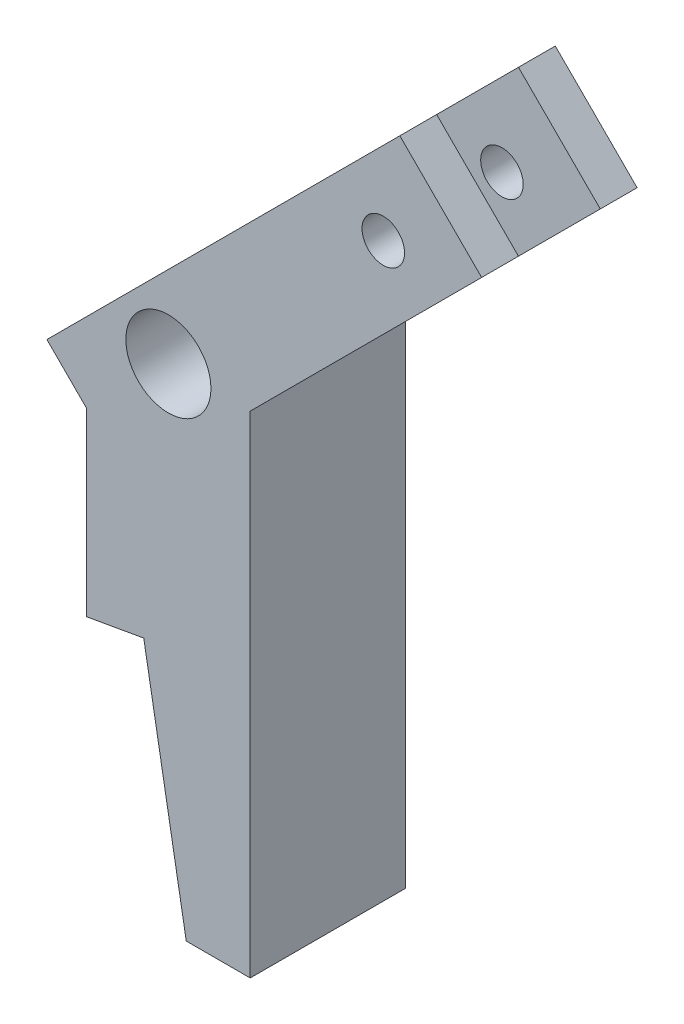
from build123d import *

# Parameters (mm, degrees)
SKIZZE1_W                            = 10
SKIZZE1_H                            = 30
AUFSATZ_LINEAR_AUSTRAGEN1_DEPTH      = 9.5
AUFSATZ_LINEAR_AUSTRAGEN2_DEPTH      = 20
AUFSATZ_LINEAR_AUSTRAGEN2_DEPTH_BACK = 10.5
SKIZZE2_W                            = 9.5
SKIZZE2_H                            = 7.071067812
SKIZZE3_R                            = 2.6
SCHNITT_LINEAR_AUSTRAGEN1_DEPTH      = 10
SKIZZE4_W                            = 5
SKIZZE4_H                            = 15.227770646
SCHNITT_LINEAR_AUSTRAGEN2_DEPTH      = 10
SKIZZE5_R                            = 1.3
SCHNITT_LINEAR_AUSTRAGEN3_DEPTH      = 20
SKIZZE6_W                            = 9.5
SKIZZE6_H                            = 15
SCHNITT_LINEAR_AUSTRAGEN4_DEPTH      = 6
FASE1_SIZE                           = 3
FASE1_SIZE2                          = 6.433520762


with BuildPart() as part:
    # Skizze1 → Aufsatz-Linear austragen1 (new body)
    with BuildSketch(Plane.XY):
        Rectangle(SKIZZE1_W, SKIZZE1_H)
    extrude(amount=AUFSATZ_LINEAR_AUSTRAGEN1_DEPTH)

    # Skizze2 → Aufsatz-Linear austragen2 (add, two sides: drawn at the far end of the back side and taken through both)
    with BuildSketch(Plane(origin=(10, 10, 0), x_dir=(0, 0, -1), z_dir=(0.7071067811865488, 0.7071067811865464, 0)).offset(-AUFSATZ_LINEAR_AUSTRAGEN2_DEPTH_BACK)):
        with Locations((-4.75, 10.606601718)):
            Rectangle(SKIZZE2_W, SKIZZE2_H)
    extrude(amount=AUFSATZ_LINEAR_AUSTRAGEN2_DEPTH + AUFSATZ_LINEAR_AUSTRAGEN2_DEPTH_BACK)

    # Skizze3 → Schnitt-Linear austragen1 (cut)
    with BuildSketch(Plane.XY.offset(9.5)):
        with Locations((0, 15)):
            Circle(SKIZZE3_R)
    extrude(amount=-SCHNITT_LINEAR_AUSTRAGEN1_DEPTH, mode=Mode.SUBTRACT)

    # Skizze4 → Schnitt-Linear austragen2 (cut)
    with BuildSketch(Plane(origin=(24.142135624, 24.142135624, 0), x_dir=(0, 0, -1), z_dir=(0.7071067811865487, 0.7071067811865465, 0))):
        with Locations((-4.75, 12.071067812)):
            Rectangle(SKIZZE4_W, SKIZZE4_H)
    extrude(amount=-SCHNITT_LINEAR_AUSTRAGEN2_DEPTH, mode=Mode.SUBTRACT)

    # Skizze5 → Schnitt-Linear austragen3 (cut)
    with BuildSketch(Plane(origin=(0, 0, 0), x_dir=(-1, 0, 0), z_dir=(0, 0, -1))):
        with Locations(Location((-13.131727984, 28.081475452, 0), (0, 0, 270))):
            Circle(SKIZZE5_R)
    extrude(amount=-SCHNITT_LINEAR_AUSTRAGEN3_DEPTH, mode=Mode.SUBTRACT)

    # Skizze6 → Schnitt-Linear austragen4 (cut)
    with BuildSketch(Plane(origin=(-7.414382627, -1.307355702, 0), x_dir=(0, 0, -1), z_dir=(-0.984807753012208, -0.17364817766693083, 0))):
        with Locations((-4.75, 7.5)):
            Rectangle(SKIZZE6_W, SKIZZE6_H)
    extrude(amount=-SCHNITT_LINEAR_AUSTRAGEN4_DEPTH, mode=Mode.SUBTRACT)

    # Fase1
    fase1_edges = [part.edges().sort_by_distance(p)[0] for p in [
        (7.071067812, 27.071067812, 4.75),
    ]]
    fase1_side = [part.faces().sort_by_distance(p)[0] for p in [
        (9.571067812, 24.571067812, 4.75),
    ]]
    chamfer(fase1_edges, length=FASE1_SIZE, length2=FASE1_SIZE2, reference=fase1_side[0])


solid = part.part
